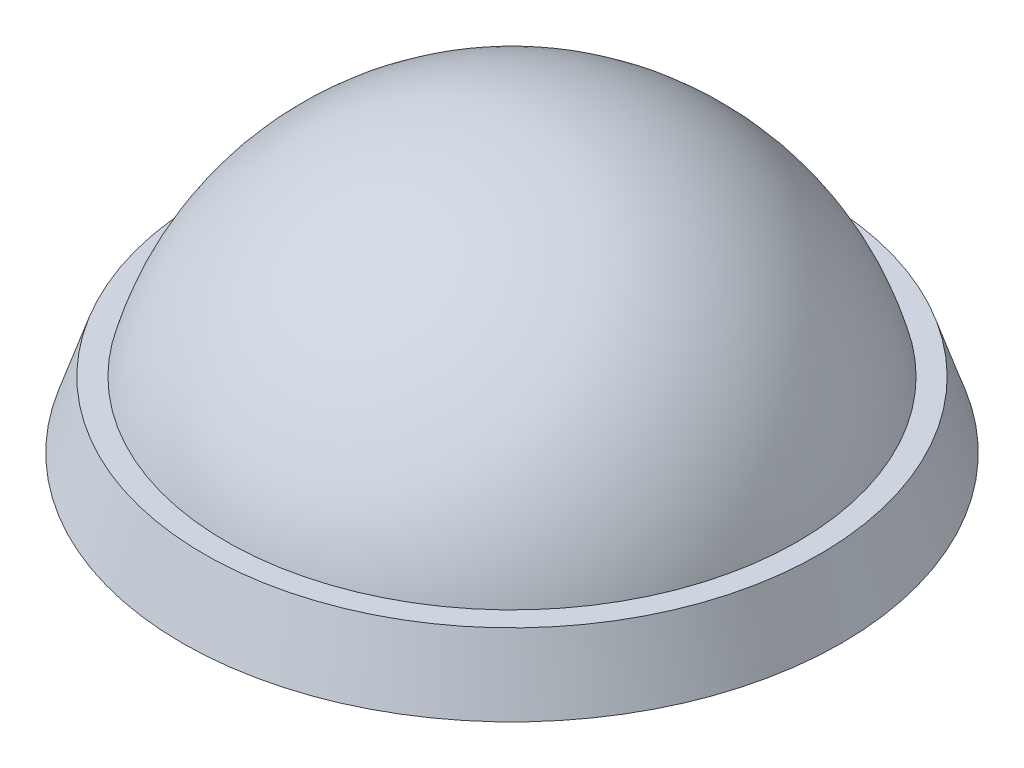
from build123d import *


with BuildPart() as part:
    # Sketch1 → Revolve1 (revolve)
    with BuildSketch(Plane.XY, mode=Mode.PRIVATE) as revolve1_sk:
        with BuildLine():
            Line((14.829497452, 3), (14.827802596, 0))
            Line((14.827802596, 0), (19.827802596, 0))
            Line((19.827802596, 0), (18.827802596, 3))
            Line((18.827802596, 3), (17.827802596, 3))
            ThreePointArc((17.827802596, 3), (13.028412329, 10.210792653), (4.827802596, 13))
            Line((4.827802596, 13), (4.827802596, 10.13))
            ThreePointArc((4.827802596, 10.13), (10.96927636, 8.165027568), (14.829497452, 3))
        make_face()
    revolve(revolve1_sk.sketch.rotate(Axis((4.827802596, 10.13, 0), (0, 1, 0)), 90), axis=Axis((4.827802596, 10.13, 0), (0, 1, 0)))


solid = part.part
